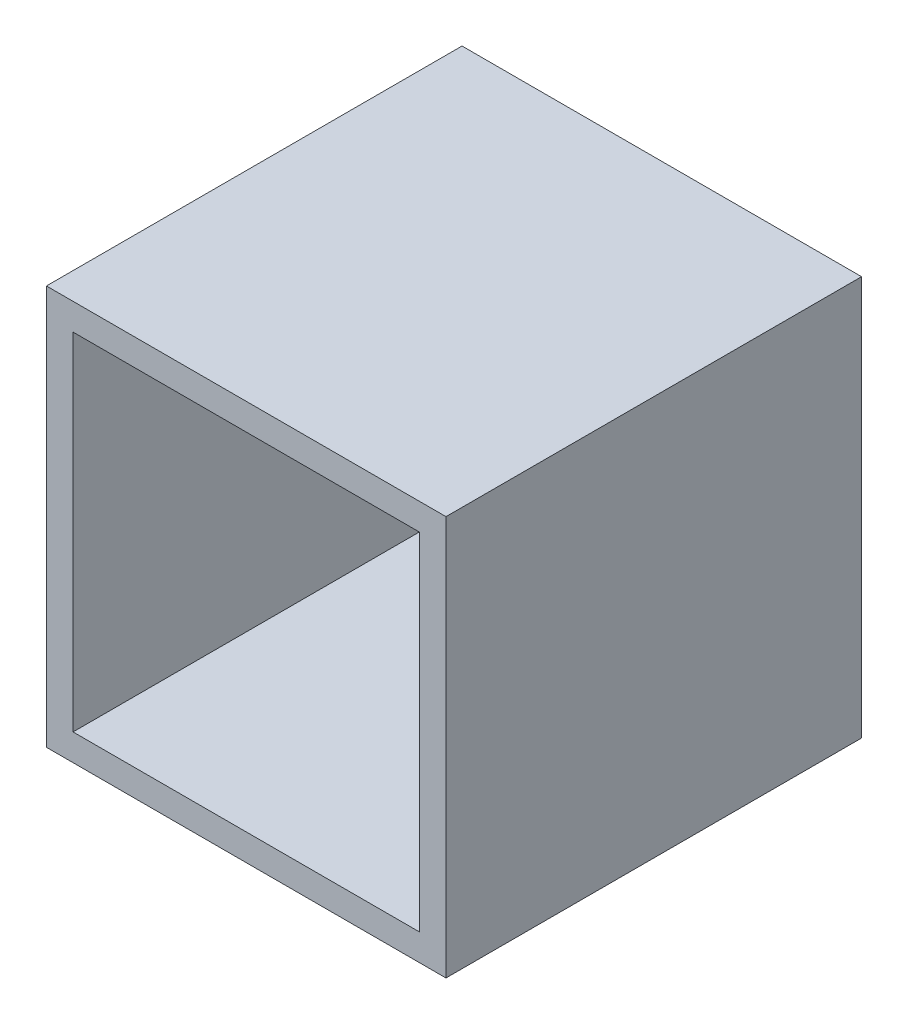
ISO-10303-21;
HEADER;
FILE_DESCRIPTION(('STEP AP214'),'2;1');
FILE_NAME('part.step','',(''),(''),'','','');
FILE_SCHEMA(('AUTOMOTIVE_DESIGN { 1 0 10303 214 1 1 1 1 }'));
ENDSEC;
DATA;
#1=APPLICATION_CONTEXT('core data for automotive mechanical design processes');
#2=APPLICATION_PROTOCOL_DEFINITION('international standard','automotive_design',2000,#1);
#3=PRODUCT_CONTEXT('',#1,'mechanical');
#4=PRODUCT('Part','Part','',(#3));
#5=PRODUCT_RELATED_PRODUCT_CATEGORY('part','',(#4));
#6=PRODUCT_DEFINITION_FORMATION('','',#4);
#7=PRODUCT_DEFINITION_CONTEXT('part definition',#1,'design');
#8=PRODUCT_DEFINITION('design','',#6,#7);
#9=PRODUCT_DEFINITION_SHAPE('','',#8);
#10=(LENGTH_UNIT() NAMED_UNIT(*) SI_UNIT(.MILLI.,.METRE.));
#11=(NAMED_UNIT(*) PLANE_ANGLE_UNIT() SI_UNIT($,.RADIAN.));
#12=(NAMED_UNIT(*) SI_UNIT($,.STERADIAN.) SOLID_ANGLE_UNIT());
#13=UNCERTAINTY_MEASURE_WITH_UNIT(LENGTH_MEASURE(1.E-05),#10,'distance_accuracy_value','');
#14=(GEOMETRIC_REPRESENTATION_CONTEXT(3) GLOBAL_UNCERTAINTY_ASSIGNED_CONTEXT((#13)) GLOBAL_UNIT_ASSIGNED_CONTEXT((#10,
#11,#12)) REPRESENTATION_CONTEXT('',''));
#15=CARTESIAN_POINT('',(0.,0.,0.));
#16=DIRECTION('',(0.,0.,1.));
#17=DIRECTION('',(1.,0.,0.));
#18=AXIS2_PLACEMENT_3D('',#15,#16,#17);
#19=CARTESIAN_POINT('',(0.,0.,62.4098856));
#20=DIRECTION('',(0.,0.,1.));
#21=DIRECTION('',(1.,0.,0.));
#22=AXIS2_PLACEMENT_3D('',#19,#20,#21);
#23=PLANE('',#22);
#24=DIRECTION('',(0.,-1.,0.));
#25=VECTOR('',#24,1.);
#26=CARTESIAN_POINT('',(-26.,26.,62.4098856));
#27=LINE('',#26,#25);
#28=CARTESIAN_POINT('',(-26.,26.,62.4098856));
#29=VERTEX_POINT('',#28);
#30=CARTESIAN_POINT('',(-26.,-26.,62.4098856));
#31=VERTEX_POINT('',#30);
#32=EDGE_CURVE('E24',#29,#31,#27,.T.);
#33=ORIENTED_EDGE('',*,*,#32,.F.);
#34=DIRECTION('',(-1.,0.,0.));
#35=VECTOR('',#34,1.);
#36=CARTESIAN_POINT('',(26.,26.,62.4098856));
#37=LINE('',#36,#35);
#38=CARTESIAN_POINT('',(26.,26.,62.4098856));
#39=VERTEX_POINT('',#38);
#40=EDGE_CURVE('E85',#39,#29,#37,.T.);
#41=ORIENTED_EDGE('',*,*,#40,.F.);
#42=DIRECTION('',(0.,1.,0.));
#43=VECTOR('',#42,1.);
#44=CARTESIAN_POINT('',(26.,-26.,62.4098856));
#45=LINE('',#44,#43);
#46=CARTESIAN_POINT('',(26.,-26.,62.4098856));
#47=VERTEX_POINT('',#46);
#48=EDGE_CURVE('E89',#47,#39,#45,.T.);
#49=ORIENTED_EDGE('',*,*,#48,.F.);
#50=DIRECTION('',(1.,0.,0.));
#51=VECTOR('',#50,1.);
#52=CARTESIAN_POINT('',(-26.,-26.,62.4098856));
#53=LINE('',#52,#51);
#54=EDGE_CURVE('E128',#31,#47,#53,.T.);
#55=ORIENTED_EDGE('',*,*,#54,.F.);
#56=EDGE_LOOP('',(#33,#41,#49,#55));
#57=FACE_BOUND('',#56,.T.);
#58=DIRECTION('',(1.,0.,0.));
#59=VECTOR('',#58,1.);
#60=CARTESIAN_POINT('',(-30.,-30.,62.4098856));
#61=LINE('',#60,#59);
#62=CARTESIAN_POINT('',(-30.,-30.,62.4098856));
#63=VERTEX_POINT('',#62);
#64=CARTESIAN_POINT('',(30.,-30.,62.4098856));
#65=VERTEX_POINT('',#64);
#66=EDGE_CURVE('E190',#63,#65,#61,.T.);
#67=ORIENTED_EDGE('',*,*,#66,.T.);
#68=DIRECTION('',(0.,1.,0.));
#69=VECTOR('',#68,1.);
#70=CARTESIAN_POINT('',(30.,-30.,62.4098856));
#71=LINE('',#70,#69);
#72=CARTESIAN_POINT('',(30.,30.,62.4098856));
#73=VERTEX_POINT('',#72);
#74=EDGE_CURVE('E181',#65,#73,#71,.T.);
#75=ORIENTED_EDGE('',*,*,#74,.T.);
#76=DIRECTION('',(-1.,0.,0.));
#77=VECTOR('',#76,1.);
#78=CARTESIAN_POINT('',(30.,30.,62.4098856));
#79=LINE('',#78,#77);
#80=CARTESIAN_POINT('',(-30.,30.,62.4098856));
#81=VERTEX_POINT('',#80);
#82=EDGE_CURVE('E144',#73,#81,#79,.T.);
#83=ORIENTED_EDGE('',*,*,#82,.T.);
#84=DIRECTION('',(0.,-1.,0.));
#85=VECTOR('',#84,1.);
#86=CARTESIAN_POINT('',(-30.,30.,62.4098856));
#87=LINE('',#86,#85);
#88=EDGE_CURVE('E135',#81,#63,#87,.T.);
#89=ORIENTED_EDGE('',*,*,#88,.T.);
#90=EDGE_LOOP('',(#67,#75,#83,#89));
#91=FACE_BOUND('',#90,.T.);
#92=ADVANCED_FACE('F16',(#57,#91),#23,.T.);
#93=CARTESIAN_POINT('',(0.,0.,0.));
#94=DIRECTION('',(0.,0.,1.));
#95=DIRECTION('',(1.,0.,0.));
#96=AXIS2_PLACEMENT_3D('',#93,#94,#95);
#97=PLANE('',#96);
#98=DIRECTION('',(1.,0.,0.));
#99=VECTOR('',#98,1.);
#100=CARTESIAN_POINT('',(-26.,-26.,0.));
#101=LINE('',#100,#99);
#102=CARTESIAN_POINT('',(-26.,-26.,0.));
#103=VERTEX_POINT('',#102);
#104=CARTESIAN_POINT('',(26.,-26.,0.));
#105=VERTEX_POINT('',#104);
#106=EDGE_CURVE('E110',#103,#105,#101,.T.);
#107=ORIENTED_EDGE('',*,*,#106,.T.);
#108=DIRECTION('',(0.,1.,0.));
#109=VECTOR('',#108,1.);
#110=CARTESIAN_POINT('',(26.,-26.,0.));
#111=LINE('',#110,#109);
#112=CARTESIAN_POINT('',(26.,26.,0.));
#113=VERTEX_POINT('',#112);
#114=EDGE_CURVE('E95',#105,#113,#111,.T.);
#115=ORIENTED_EDGE('',*,*,#114,.T.);
#116=DIRECTION('',(-1.,0.,0.));
#117=VECTOR('',#116,1.);
#118=CARTESIAN_POINT('',(26.,26.,0.));
#119=LINE('',#118,#117);
#120=CARTESIAN_POINT('',(-26.,26.,0.));
#121=VERTEX_POINT('',#120);
#122=EDGE_CURVE('E100',#113,#121,#119,.T.);
#123=ORIENTED_EDGE('',*,*,#122,.T.);
#124=DIRECTION('',(0.,-1.,0.));
#125=VECTOR('',#124,1.);
#126=CARTESIAN_POINT('',(-26.,26.,0.));
#127=LINE('',#126,#125);
#128=EDGE_CURVE('E10',#121,#103,#127,.T.);
#129=ORIENTED_EDGE('',*,*,#128,.T.);
#130=EDGE_LOOP('',(#107,#115,#123,#129));
#131=FACE_BOUND('',#130,.T.);
#132=DIRECTION('',(0.,-1.,0.));
#133=VECTOR('',#132,1.);
#134=CARTESIAN_POINT('',(-30.,30.,0.));
#135=LINE('',#134,#133);
#136=CARTESIAN_POINT('',(-30.,30.,0.));
#137=VERTEX_POINT('',#136);
#138=CARTESIAN_POINT('',(-30.,-30.,0.));
#139=VERTEX_POINT('',#138);
#140=EDGE_CURVE('E141',#137,#139,#135,.T.);
#141=ORIENTED_EDGE('',*,*,#140,.F.);
#142=DIRECTION('',(-1.,0.,0.));
#143=VECTOR('',#142,1.);
#144=CARTESIAN_POINT('',(30.,30.,0.));
#145=LINE('',#144,#143);
#146=CARTESIAN_POINT('',(30.,30.,0.));
#147=VERTEX_POINT('',#146);
#148=EDGE_CURVE('E160',#147,#137,#145,.T.);
#149=ORIENTED_EDGE('',*,*,#148,.F.);
#150=DIRECTION('',(0.,1.,0.));
#151=VECTOR('',#150,1.);
#152=CARTESIAN_POINT('',(30.,-30.,0.));
#153=LINE('',#152,#151);
#154=CARTESIAN_POINT('',(30.,-30.,0.));
#155=VERTEX_POINT('',#154);
#156=EDGE_CURVE('E195',#155,#147,#153,.T.);
#157=ORIENTED_EDGE('',*,*,#156,.F.);
#158=DIRECTION('',(1.,0.,0.));
#159=VECTOR('',#158,1.);
#160=CARTESIAN_POINT('',(-30.,-30.,0.));
#161=LINE('',#160,#159);
#162=EDGE_CURVE('E164',#139,#155,#161,.T.);
#163=ORIENTED_EDGE('',*,*,#162,.F.);
#164=EDGE_LOOP('',(#141,#149,#157,#163));
#165=FACE_BOUND('',#164,.T.);
#166=ADVANCED_FACE('F149',(#131,#165),#97,.F.);
#167=CARTESIAN_POINT('',(-26.,26.,0.));
#168=DIRECTION('',(1.,0.,0.));
#169=DIRECTION('',(0.,1.,0.));
#170=AXIS2_PLACEMENT_3D('',#167,#168,#169);
#171=PLANE('',#170);
#172=DIRECTION('',(0.,0.,1.));
#173=VECTOR('',#172,1.);
#174=CARTESIAN_POINT('',(-26.,26.,0.));
#175=LINE('',#174,#173);
#176=EDGE_CURVE('E94',#121,#29,#175,.T.);
#177=ORIENTED_EDGE('',*,*,#176,.T.);
#178=ORIENTED_EDGE('',*,*,#32,.T.);
#179=DIRECTION('',(0.,0.,1.));
#180=VECTOR('',#179,1.);
#181=CARTESIAN_POINT('',(-26.,-26.,0.));
#182=LINE('',#181,#180);
#183=EDGE_CURVE('E127',#103,#31,#182,.T.);
#184=ORIENTED_EDGE('',*,*,#183,.F.);
#185=ORIENTED_EDGE('',*,*,#128,.F.);
#186=EDGE_LOOP('',(#177,#178,#184,#185));
#187=FACE_BOUND('',#186,.T.);
#188=ADVANCED_FACE('F125',(#187),#171,.T.);
#189=CARTESIAN_POINT('',(26.,26.,0.));
#190=DIRECTION('',(0.,-1.,0.));
#191=DIRECTION('',(0.,0.,-1.));
#192=AXIS2_PLACEMENT_3D('',#189,#190,#191);
#193=PLANE('',#192);
#194=DIRECTION('',(0.,0.,1.));
#195=VECTOR('',#194,1.);
#196=CARTESIAN_POINT('',(26.,26.,0.));
#197=LINE('',#196,#195);
#198=EDGE_CURVE('E98',#113,#39,#197,.T.);
#199=ORIENTED_EDGE('',*,*,#198,.T.);
#200=ORIENTED_EDGE('',*,*,#40,.T.);
#201=ORIENTED_EDGE('',*,*,#176,.F.);
#202=ORIENTED_EDGE('',*,*,#122,.F.);
#203=EDGE_LOOP('',(#199,#200,#201,#202));
#204=FACE_BOUND('',#203,.T.);
#205=ADVANCED_FACE('F99',(#204),#193,.T.);
#206=CARTESIAN_POINT('',(26.,-26.,0.));
#207=DIRECTION('',(-1.,0.,0.));
#208=DIRECTION('',(0.,0.,1.));
#209=AXIS2_PLACEMENT_3D('',#206,#207,#208);
#210=PLANE('',#209);
#211=DIRECTION('',(0.,0.,1.));
#212=VECTOR('',#211,1.);
#213=CARTESIAN_POINT('',(26.,-26.,0.));
#214=LINE('',#213,#212);
#215=EDGE_CURVE('E107',#105,#47,#214,.T.);
#216=ORIENTED_EDGE('',*,*,#215,.T.);
#217=ORIENTED_EDGE('',*,*,#48,.T.);
#218=ORIENTED_EDGE('',*,*,#198,.F.);
#219=ORIENTED_EDGE('',*,*,#114,.F.);
#220=EDGE_LOOP('',(#216,#217,#218,#219));
#221=FACE_BOUND('',#220,.T.);
#222=ADVANCED_FACE('F105',(#221),#210,.T.);
#223=CARTESIAN_POINT('',(-26.,-26.,0.));
#224=DIRECTION('',(0.,1.,0.));
#225=DIRECTION('',(1.,0.,0.));
#226=AXIS2_PLACEMENT_3D('',#223,#224,#225);
#227=PLANE('',#226);
#228=ORIENTED_EDGE('',*,*,#183,.T.);
#229=ORIENTED_EDGE('',*,*,#54,.T.);
#230=ORIENTED_EDGE('',*,*,#215,.F.);
#231=ORIENTED_EDGE('',*,*,#106,.F.);
#232=EDGE_LOOP('',(#228,#229,#230,#231));
#233=FACE_BOUND('',#232,.T.);
#234=ADVANCED_FACE('F133',(#233),#227,.T.);
#235=CARTESIAN_POINT('',(-30.,30.,0.));
#236=DIRECTION('',(1.,0.,0.));
#237=DIRECTION('',(0.,1.,0.));
#238=AXIS2_PLACEMENT_3D('',#235,#236,#237);
#239=PLANE('',#238);
#240=ORIENTED_EDGE('',*,*,#140,.T.);
#241=DIRECTION('',(0.,0.,1.));
#242=VECTOR('',#241,1.);
#243=CARTESIAN_POINT('',(-30.,-30.,0.));
#244=LINE('',#243,#242);
#245=EDGE_CURVE('E193',#139,#63,#244,.T.);
#246=ORIENTED_EDGE('',*,*,#245,.T.);
#247=ORIENTED_EDGE('',*,*,#88,.F.);
#248=DIRECTION('',(0.,0.,1.));
#249=VECTOR('',#248,1.);
#250=CARTESIAN_POINT('',(-30.,30.,0.));
#251=LINE('',#250,#249);
#252=EDGE_CURVE('E171',#137,#81,#251,.T.);
#253=ORIENTED_EDGE('',*,*,#252,.F.);
#254=EDGE_LOOP('',(#240,#246,#247,#253));
#255=FACE_BOUND('',#254,.T.);
#256=ADVANCED_FACE('F172',(#255),#239,.F.);
#257=CARTESIAN_POINT('',(30.,30.,0.));
#258=DIRECTION('',(0.,-1.,0.));
#259=DIRECTION('',(0.,0.,-1.));
#260=AXIS2_PLACEMENT_3D('',#257,#258,#259);
#261=PLANE('',#260);
#262=ORIENTED_EDGE('',*,*,#148,.T.);
#263=ORIENTED_EDGE('',*,*,#252,.T.);
#264=ORIENTED_EDGE('',*,*,#82,.F.);
#265=DIRECTION('',(0.,0.,1.));
#266=VECTOR('',#265,1.);
#267=CARTESIAN_POINT('',(30.,30.,0.));
#268=LINE('',#267,#266);
#269=EDGE_CURVE('E178',#147,#73,#268,.T.);
#270=ORIENTED_EDGE('',*,*,#269,.F.);
#271=EDGE_LOOP('',(#262,#263,#264,#270));
#272=FACE_BOUND('',#271,.T.);
#273=ADVANCED_FACE('F176',(#272),#261,.F.);
#274=CARTESIAN_POINT('',(30.,-30.,0.));
#275=DIRECTION('',(-1.,0.,0.));
#276=DIRECTION('',(0.,0.,1.));
#277=AXIS2_PLACEMENT_3D('',#274,#275,#276);
#278=PLANE('',#277);
#279=ORIENTED_EDGE('',*,*,#156,.T.);
#280=ORIENTED_EDGE('',*,*,#269,.T.);
#281=ORIENTED_EDGE('',*,*,#74,.F.);
#282=DIRECTION('',(0.,0.,1.));
#283=VECTOR('',#282,1.);
#284=CARTESIAN_POINT('',(30.,-30.,0.));
#285=LINE('',#284,#283);
#286=EDGE_CURVE('E194',#155,#65,#285,.T.);
#287=ORIENTED_EDGE('',*,*,#286,.F.);
#288=EDGE_LOOP('',(#279,#280,#281,#287));
#289=FACE_BOUND('',#288,.T.);
#290=ADVANCED_FACE('F271',(#289),#278,.F.);
#291=CARTESIAN_POINT('',(-30.,-30.,0.));
#292=DIRECTION('',(0.,1.,0.));
#293=DIRECTION('',(1.,0.,0.));
#294=AXIS2_PLACEMENT_3D('',#291,#292,#293);
#295=PLANE('',#294);
#296=ORIENTED_EDGE('',*,*,#162,.T.);
#297=ORIENTED_EDGE('',*,*,#286,.T.);
#298=ORIENTED_EDGE('',*,*,#66,.F.);
#299=ORIENTED_EDGE('',*,*,#245,.F.);
#300=EDGE_LOOP('',(#296,#297,#298,#299));
#301=FACE_BOUND('',#300,.T.);
#302=ADVANCED_FACE('F215',(#301),#295,.F.);
#303=CLOSED_SHELL('',(#92,#166,#188,#205,#222,#234,#256,#273,#290,#302));
#304=MANIFOLD_SOLID_BREP('B1',#303);
#305=ADVANCED_BREP_SHAPE_REPRESENTATION('',(#18,#304),#14);
#306=SHAPE_DEFINITION_REPRESENTATION(#9,#305);
ENDSEC;
END-ISO-10303-21;
